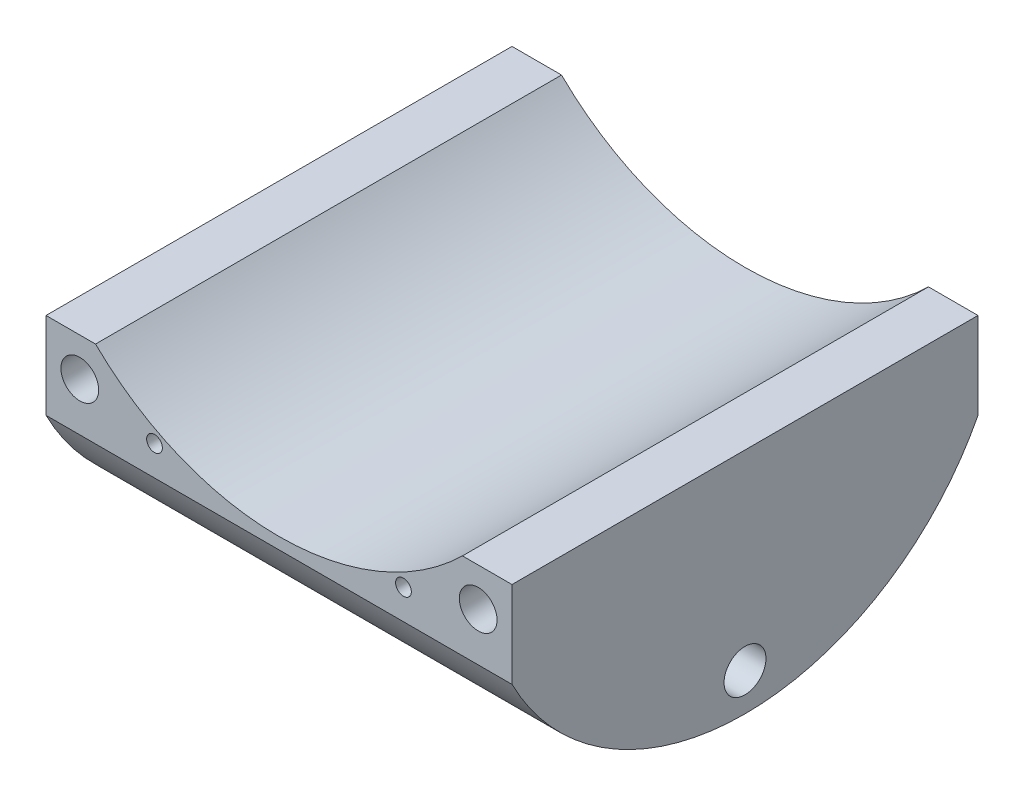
ISO-10303-21;
HEADER;
FILE_DESCRIPTION(('STEP AP214'),'2;1');
FILE_NAME('part.step','',(''),(''),'','','');
FILE_SCHEMA(('AUTOMOTIVE_DESIGN { 1 0 10303 214 1 1 1 1 }'));
ENDSEC;
DATA;
#1=APPLICATION_CONTEXT('core data for automotive mechanical design processes');
#2=APPLICATION_PROTOCOL_DEFINITION('international standard','automotive_design',2000,#1);
#3=PRODUCT_CONTEXT('',#1,'mechanical');
#4=PRODUCT('Part','Part','',(#3));
#5=PRODUCT_RELATED_PRODUCT_CATEGORY('part','',(#4));
#6=PRODUCT_DEFINITION_FORMATION('','',#4);
#7=PRODUCT_DEFINITION_CONTEXT('part definition',#1,'design');
#8=PRODUCT_DEFINITION('design','',#6,#7);
#9=PRODUCT_DEFINITION_SHAPE('','',#8);
#10=(LENGTH_UNIT() NAMED_UNIT(*) SI_UNIT(.MILLI.,.METRE.));
#11=(NAMED_UNIT(*) PLANE_ANGLE_UNIT() SI_UNIT($,.RADIAN.));
#12=(NAMED_UNIT(*) SI_UNIT($,.STERADIAN.) SOLID_ANGLE_UNIT());
#13=UNCERTAINTY_MEASURE_WITH_UNIT(LENGTH_MEASURE(1.E-05),#10,'distance_accuracy_value','');
#14=(GEOMETRIC_REPRESENTATION_CONTEXT(3) GLOBAL_UNCERTAINTY_ASSIGNED_CONTEXT((#13)) GLOBAL_UNIT_ASSIGNED_CONTEXT((#10,
#11,#12)) REPRESENTATION_CONTEXT('',''));
#15=CARTESIAN_POINT('',(0.,0.,0.));
#16=DIRECTION('',(0.,0.,1.));
#17=DIRECTION('',(1.,0.,0.));
#18=AXIS2_PLACEMENT_3D('',#15,#16,#17);
#19=CARTESIAN_POINT('',(44.45,0.,-44.45));
#20=DIRECTION('',(0.,0.,1.));
#21=DIRECTION('',(1.,0.,0.));
#22=AXIS2_PLACEMENT_3D('',#19,#20,#21);
#23=PLANE('',#22);
#24=CARTESIAN_POINT('',(-23.75,-10.8,-44.45));
#25=DIRECTION('',(0.,0.,1.));
#26=DIRECTION('',(1.,0.,0.));
#27=AXIS2_PLACEMENT_3D('',#24,#25,#26);
#28=CIRCLE('',#27,1.49999999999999);
#29=CARTESIAN_POINT('',(-25.25,-10.8,-44.45));
#30=VERTEX_POINT('',#29);
#31=EDGE_CURVE('E436',#30,#30,#28,.T.);
#32=ORIENTED_EDGE('',*,*,#31,.T.);
#33=EDGE_LOOP('',(#32));
#34=FACE_BOUND('',#33,.T.);
#35=CARTESIAN_POINT('',(-38.,-7.29999999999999,-44.45));
#36=DIRECTION('',(0.,0.,-1.));
#37=DIRECTION('',(-1.,0.,0.));
#38=AXIS2_PLACEMENT_3D('',#35,#36,#37);
#39=CIRCLE('',#38,3.59999999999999);
#40=CARTESIAN_POINT('',(-41.6,-7.29999999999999,-44.45));
#41=VERTEX_POINT('',#40);
#42=EDGE_CURVE('E127',#41,#41,#39,.T.);
#43=ORIENTED_EDGE('',*,*,#42,.F.);
#44=EDGE_LOOP('',(#43));
#45=FACE_BOUND('',#44,.T.);
#46=CARTESIAN_POINT('',(38.,-7.29999999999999,-44.45));
#47=DIRECTION('',(0.,0.,-1.));
#48=DIRECTION('',(-1.,0.,0.));
#49=AXIS2_PLACEMENT_3D('',#46,#47,#48);
#50=CIRCLE('',#49,3.59999999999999);
#51=CARTESIAN_POINT('',(34.4,-7.29999999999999,-44.45));
#52=VERTEX_POINT('',#51);
#53=EDGE_CURVE('E133',#52,#52,#50,.T.);
#54=ORIENTED_EDGE('',*,*,#53,.F.);
#55=EDGE_LOOP('',(#54));
#56=FACE_BOUND('',#55,.T.);
#57=DIRECTION('',(-1.,0.,0.));
#58=VECTOR('',#57,1.);
#59=CARTESIAN_POINT('',(44.45,0.,-44.45));
#60=LINE('',#59,#58);
#61=CARTESIAN_POINT('',(-35.,0.,-44.45));
#62=VERTEX_POINT('',#61);
#63=CARTESIAN_POINT('',(-44.45,0.,-44.45));
#64=VERTEX_POINT('',#63);
#65=EDGE_CURVE('E177',#62,#64,#60,.T.);
#66=ORIENTED_EDGE('',*,*,#65,.F.);
#67=CARTESIAN_POINT('',(0.,35.7071421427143,-44.45));
#68=DIRECTION('',(0.,0.,-1.));
#69=DIRECTION('',(-1.,0.,0.));
#70=AXIS2_PLACEMENT_3D('',#67,#68,#69);
#71=CIRCLE('',#70,50.);
#72=CARTESIAN_POINT('',(35.,0.,-44.45));
#73=VERTEX_POINT('',#72);
#74=EDGE_CURVE('E149',#73,#62,#71,.T.);
#75=ORIENTED_EDGE('',*,*,#74,.F.);
#76=CARTESIAN_POINT('',(44.45,0.,-44.45));
#77=VERTEX_POINT('',#76);
#78=EDGE_CURVE('E178',#77,#73,#60,.T.);
#79=ORIENTED_EDGE('',*,*,#78,.F.);
#80=DIRECTION('',(0.,1.,0.));
#81=VECTOR('',#80,1.);
#82=CARTESIAN_POINT('',(44.45,0.,-44.45));
#83=LINE('',#82,#81);
#84=CARTESIAN_POINT('',(44.45,-16.5,-44.45));
#85=VERTEX_POINT('',#84);
#86=EDGE_CURVE('E164',#85,#77,#83,.T.);
#87=ORIENTED_EDGE('',*,*,#86,.F.);
#88=DIRECTION('',(-1.,0.,0.));
#89=VECTOR('',#88,1.);
#90=CARTESIAN_POINT('',(44.45,-16.5,-44.45));
#91=LINE('',#90,#89);
#92=CARTESIAN_POINT('',(-44.45,-16.5,-44.45));
#93=VERTEX_POINT('',#92);
#94=EDGE_CURVE('E40',#85,#93,#91,.T.);
#95=ORIENTED_EDGE('',*,*,#94,.T.);
#96=DIRECTION('',(0.,1.,0.));
#97=VECTOR('',#96,1.);
#98=CARTESIAN_POINT('',(-44.45,0.,-44.45));
#99=LINE('',#98,#97);
#100=EDGE_CURVE('E170',#93,#64,#99,.T.);
#101=ORIENTED_EDGE('',*,*,#100,.T.);
#102=EDGE_LOOP('',(#66,#75,#79,#87,#95,#101));
#103=FACE_BOUND('',#102,.T.);
#104=CARTESIAN_POINT('',(23.75,-10.8,-44.45));
#105=DIRECTION('',(0.,0.,1.));
#106=DIRECTION('',(1.,0.,0.));
#107=AXIS2_PLACEMENT_3D('',#104,#105,#106);
#108=CIRCLE('',#107,1.49999999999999);
#109=CARTESIAN_POINT('',(22.25,-10.8,-44.45));
#110=VERTEX_POINT('',#109);
#111=EDGE_CURVE('E437',#110,#110,#108,.T.);
#112=ORIENTED_EDGE('',*,*,#111,.T.);
#113=EDGE_LOOP('',(#112));
#114=FACE_BOUND('',#113,.T.);
#115=ADVANCED_FACE('F32',(#34,#45,#56,#103,#114),#23,.F.);
#116=CARTESIAN_POINT('',(-44.45,6.39535979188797,0.));
#117=DIRECTION('',(1.,0.,0.));
#118=DIRECTION('',(0.,0.,-1.));
#119=AXIS2_PLACEMENT_3D('',#116,#117,#118);
#120=PLANE('',#119);
#121=DIRECTION('',(0.,-1.,0.));
#122=VECTOR('',#121,1.);
#123=CARTESIAN_POINT('',(-44.45,0.,44.45));
#124=LINE('',#123,#122);
#125=CARTESIAN_POINT('',(-44.45,0.,44.45));
#126=VERTEX_POINT('',#125);
#127=CARTESIAN_POINT('',(-44.45,-16.5,44.45));
#128=VERTEX_POINT('',#127);
#129=EDGE_CURVE('E157',#126,#128,#124,.T.);
#130=ORIENTED_EDGE('',*,*,#129,.F.);
#131=DIRECTION('',(0.,0.,1.));
#132=VECTOR('',#131,1.);
#133=CARTESIAN_POINT('',(-44.45,0.,44.45));
#134=LINE('',#133,#132);
#135=EDGE_CURVE('E162',#64,#126,#134,.T.);
#136=ORIENTED_EDGE('',*,*,#135,.F.);
#137=ORIENTED_EDGE('',*,*,#100,.F.);
#138=CARTESIAN_POINT('',(-44.45,6.39535979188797,0.));
#139=DIRECTION('',(1.,0.,0.));
#140=DIRECTION('',(0.,0.,-1.));
#141=AXIS2_PLACEMENT_3D('',#138,#139,#140);
#142=CIRCLE('',#141,50.);
#143=EDGE_CURVE('E168',#128,#93,#142,.T.);
#144=ORIENTED_EDGE('',*,*,#143,.F.);
#145=EDGE_LOOP('',(#130,#136,#137,#144));
#146=FACE_BOUND('',#145,.T.);
#147=CARTESIAN_POINT('',(-44.45,-36.45,0.));
#148=DIRECTION('',(1.,0.,0.));
#149=DIRECTION('',(0.,0.,-1.));
#150=AXIS2_PLACEMENT_3D('',#147,#148,#149);
#151=CIRCLE('',#150,4.);
#152=CARTESIAN_POINT('',(-44.45,-36.45,-4.));
#153=VERTEX_POINT('',#152);
#154=EDGE_CURVE('E139',#153,#153,#151,.T.);
#155=ORIENTED_EDGE('',*,*,#154,.T.);
#156=EDGE_LOOP('',(#155));
#157=FACE_BOUND('',#156,.T.);
#158=ADVANCED_FACE('F190',(#146,#157),#120,.F.);
#159=CARTESIAN_POINT('',(44.45,0.,44.45));
#160=DIRECTION('',(0.,-1.,0.));
#161=DIRECTION('',(0.,0.,-1.));
#162=AXIS2_PLACEMENT_3D('',#159,#160,#161);
#163=PLANE('',#162);
#164=DIRECTION('',(-1.,0.,0.));
#165=VECTOR('',#164,1.);
#166=CARTESIAN_POINT('',(44.45,0.,44.45));
#167=LINE('',#166,#165);
#168=CARTESIAN_POINT('',(-35.,0.,44.45));
#169=VERTEX_POINT('',#168);
#170=EDGE_CURVE('E77',#169,#126,#167,.T.);
#171=ORIENTED_EDGE('',*,*,#170,.F.);
#172=DIRECTION('',(0.,0.,-1.));
#173=VECTOR('',#172,1.);
#174=CARTESIAN_POINT('',(-35.,0.,44.45));
#175=LINE('',#174,#173);
#176=EDGE_CURVE('E153',#169,#62,#175,.T.);
#177=ORIENTED_EDGE('',*,*,#176,.T.);
#178=ORIENTED_EDGE('',*,*,#65,.T.);
#179=ORIENTED_EDGE('',*,*,#135,.T.);
#180=EDGE_LOOP('',(#171,#177,#178,#179));
#181=FACE_BOUND('',#180,.T.);
#182=ADVANCED_FACE('F193',(#181),#163,.F.);
#183=CARTESIAN_POINT('',(44.45,0.,44.45));
#184=DIRECTION('',(0.,0.,-1.));
#185=DIRECTION('',(-1.,0.,0.));
#186=AXIS2_PLACEMENT_3D('',#183,#184,#185);
#187=PLANE('',#186);
#188=CARTESIAN_POINT('',(23.75,-10.8,44.45));
#189=DIRECTION('',(0.,0.,1.));
#190=DIRECTION('',(1.,0.,0.));
#191=AXIS2_PLACEMENT_3D('',#188,#189,#190);
#192=CIRCLE('',#191,1.49999999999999);
#193=CARTESIAN_POINT('',(25.25,-10.8,44.45));
#194=VERTEX_POINT('',#193);
#195=EDGE_CURVE('E233',#194,#194,#192,.T.);
#196=ORIENTED_EDGE('',*,*,#195,.F.);
#197=EDGE_LOOP('',(#196));
#198=FACE_BOUND('',#197,.T.);
#199=CARTESIAN_POINT('',(-23.75,-10.8,44.45));
#200=DIRECTION('',(0.,0.,1.));
#201=DIRECTION('',(1.,0.,0.));
#202=AXIS2_PLACEMENT_3D('',#199,#200,#201);
#203=CIRCLE('',#202,1.49999999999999);
#204=CARTESIAN_POINT('',(-22.25,-10.8,44.45));
#205=VERTEX_POINT('',#204);
#206=EDGE_CURVE('E237',#205,#205,#203,.T.);
#207=ORIENTED_EDGE('',*,*,#206,.F.);
#208=EDGE_LOOP('',(#207));
#209=FACE_BOUND('',#208,.T.);
#210=CARTESIAN_POINT('',(-38.,-7.29999999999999,44.45));
#211=DIRECTION('',(0.,0.,1.));
#212=DIRECTION('',(1.,0.,0.));
#213=AXIS2_PLACEMENT_3D('',#210,#211,#212);
#214=CIRCLE('',#213,3.59999999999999);
#215=CARTESIAN_POINT('',(-34.4,-7.29999999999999,44.45));
#216=VERTEX_POINT('',#215);
#217=EDGE_CURVE('E115',#216,#216,#214,.T.);
#218=ORIENTED_EDGE('',*,*,#217,.F.);
#219=EDGE_LOOP('',(#218));
#220=FACE_BOUND('',#219,.T.);
#221=CARTESIAN_POINT('',(38.,-7.29999999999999,44.45));
#222=DIRECTION('',(0.,0.,1.));
#223=DIRECTION('',(1.,0.,0.));
#224=AXIS2_PLACEMENT_3D('',#221,#222,#223);
#225=CIRCLE('',#224,3.59999999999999);
#226=CARTESIAN_POINT('',(41.6,-7.29999999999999,44.45));
#227=VERTEX_POINT('',#226);
#228=EDGE_CURVE('E114',#227,#227,#225,.T.);
#229=ORIENTED_EDGE('',*,*,#228,.F.);
#230=EDGE_LOOP('',(#229));
#231=FACE_BOUND('',#230,.T.);
#232=CARTESIAN_POINT('',(44.45,0.,44.45));
#233=VERTEX_POINT('',#232);
#234=CARTESIAN_POINT('',(35.,0.,44.45));
#235=VERTEX_POINT('',#234);
#236=EDGE_CURVE('E174',#233,#235,#167,.T.);
#237=ORIENTED_EDGE('',*,*,#236,.T.);
#238=CARTESIAN_POINT('',(0.,35.7071421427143,44.45));
#239=DIRECTION('',(0.,0.,-1.));
#240=DIRECTION('',(-1.,0.,0.));
#241=AXIS2_PLACEMENT_3D('',#238,#239,#240);
#242=CIRCLE('',#241,50.);
#243=EDGE_CURVE('E47',#235,#169,#242,.T.);
#244=ORIENTED_EDGE('',*,*,#243,.T.);
#245=ORIENTED_EDGE('',*,*,#170,.T.);
#246=ORIENTED_EDGE('',*,*,#129,.T.);
#247=DIRECTION('',(-1.,0.,0.));
#248=VECTOR('',#247,1.);
#249=CARTESIAN_POINT('',(44.45,-16.5,44.45));
#250=LINE('',#249,#248);
#251=CARTESIAN_POINT('',(44.45,-16.5,44.45));
#252=VERTEX_POINT('',#251);
#253=EDGE_CURVE('E11',#252,#128,#250,.T.);
#254=ORIENTED_EDGE('',*,*,#253,.F.);
#255=DIRECTION('',(0.,-1.,0.));
#256=VECTOR('',#255,1.);
#257=CARTESIAN_POINT('',(44.45,0.,44.45));
#258=LINE('',#257,#256);
#259=EDGE_CURVE('E160',#233,#252,#258,.T.);
#260=ORIENTED_EDGE('',*,*,#259,.F.);
#261=EDGE_LOOP('',(#237,#244,#245,#246,#254,#260));
#262=FACE_BOUND('',#261,.T.);
#263=ADVANCED_FACE('F34',(#198,#209,#220,#231,#262),#187,.F.);
#264=CARTESIAN_POINT('',(44.45,6.39535979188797,0.));
#265=DIRECTION('',(-1.,0.,0.));
#266=DIRECTION('',(0.,0.,1.));
#267=AXIS2_PLACEMENT_3D('',#264,#265,#266);
#268=CYLINDRICAL_SURFACE('',#267,50.);
#269=ORIENTED_EDGE('',*,*,#143,.T.);
#270=ORIENTED_EDGE('',*,*,#94,.F.);
#271=CARTESIAN_POINT('',(44.45,6.39535979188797,0.));
#272=DIRECTION('',(1.,0.,0.));
#273=DIRECTION('',(0.,0.,-1.));
#274=AXIS2_PLACEMENT_3D('',#271,#272,#273);
#275=CIRCLE('',#274,50.);
#276=EDGE_CURVE('E84',#252,#85,#275,.T.);
#277=ORIENTED_EDGE('',*,*,#276,.F.);
#278=ORIENTED_EDGE('',*,*,#253,.T.);
#279=EDGE_LOOP('',(#269,#270,#277,#278));
#280=FACE_BOUND('',#279,.T.);
#281=ADVANCED_FACE('F210',(#280),#268,.T.);
#282=ORIENTED_EDGE('',*,*,#78,.T.);
#283=DIRECTION('',(0.,0.,-1.));
#284=VECTOR('',#283,1.);
#285=CARTESIAN_POINT('',(35.,0.,44.45));
#286=LINE('',#285,#284);
#287=EDGE_CURVE('E155',#235,#73,#286,.T.);
#288=ORIENTED_EDGE('',*,*,#287,.F.);
#289=ORIENTED_EDGE('',*,*,#236,.F.);
#290=DIRECTION('',(0.,0.,1.));
#291=VECTOR('',#290,1.);
#292=CARTESIAN_POINT('',(44.45,0.,44.45));
#293=LINE('',#292,#291);
#294=EDGE_CURVE('E56',#77,#233,#293,.T.);
#295=ORIENTED_EDGE('',*,*,#294,.F.);
#296=EDGE_LOOP('',(#282,#288,#289,#295));
#297=FACE_BOUND('',#296,.T.);
#298=ADVANCED_FACE('F196',(#297),#163,.F.);
#299=CARTESIAN_POINT('',(44.45,6.39535979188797,0.));
#300=DIRECTION('',(1.,0.,0.));
#301=DIRECTION('',(0.,0.,-1.));
#302=AXIS2_PLACEMENT_3D('',#299,#300,#301);
#303=PLANE('',#302);
#304=CARTESIAN_POINT('',(44.45,-36.45,0.));
#305=DIRECTION('',(1.,0.,0.));
#306=DIRECTION('',(0.,0.,-1.));
#307=AXIS2_PLACEMENT_3D('',#304,#305,#306);
#308=CIRCLE('',#307,4.);
#309=CARTESIAN_POINT('',(44.45,-36.45,-4.));
#310=VERTEX_POINT('',#309);
#311=EDGE_CURVE('E143',#310,#310,#308,.T.);
#312=ORIENTED_EDGE('',*,*,#311,.F.);
#313=EDGE_LOOP('',(#312));
#314=FACE_BOUND('',#313,.T.);
#315=ORIENTED_EDGE('',*,*,#259,.T.);
#316=ORIENTED_EDGE('',*,*,#276,.T.);
#317=ORIENTED_EDGE('',*,*,#86,.T.);
#318=ORIENTED_EDGE('',*,*,#294,.T.);
#319=EDGE_LOOP('',(#315,#316,#317,#318));
#320=FACE_BOUND('',#319,.T.);
#321=ADVANCED_FACE('F199',(#314,#320),#303,.T.);
#322=CARTESIAN_POINT('',(0.,35.7071421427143,44.45));
#323=DIRECTION('',(0.,0.,-1.));
#324=DIRECTION('',(-1.,0.,0.));
#325=AXIS2_PLACEMENT_3D('',#322,#323,#324);
#326=CYLINDRICAL_SURFACE('',#325,50.);
#327=ORIENTED_EDGE('',*,*,#74,.T.);
#328=ORIENTED_EDGE('',*,*,#176,.F.);
#329=ORIENTED_EDGE('',*,*,#243,.F.);
#330=ORIENTED_EDGE('',*,*,#287,.T.);
#331=EDGE_LOOP('',(#327,#328,#329,#330));
#332=FACE_BOUND('',#331,.T.);
#333=ADVANCED_FACE('F201',(#332),#326,.F.);
#334=CARTESIAN_POINT('',(26.95,-36.45,0.));
#335=DIRECTION('',(1.,0.,0.));
#336=DIRECTION('',(0.,0.,-1.));
#337=AXIS2_PLACEMENT_3D('',#334,#335,#336);
#338=CYLINDRICAL_SURFACE('',#337,4.);
#339=CARTESIAN_POINT('',(26.95,-36.45,0.));
#340=DIRECTION('',(1.,0.,0.));
#341=DIRECTION('',(0.,0.,-1.));
#342=AXIS2_PLACEMENT_3D('',#339,#340,#341);
#343=CIRCLE('',#342,4.);
#344=CARTESIAN_POINT('',(26.95,-36.45,-4.));
#345=VERTEX_POINT('',#344);
#346=EDGE_CURVE('E146',#345,#345,#343,.T.);
#347=ORIENTED_EDGE('',*,*,#346,.F.);
#348=EDGE_LOOP('',(#347));
#349=FACE_BOUND('',#348,.T.);
#350=ORIENTED_EDGE('',*,*,#311,.T.);
#351=EDGE_LOOP('',(#350));
#352=FACE_BOUND('',#351,.T.);
#353=ADVANCED_FACE('F208',(#349,#352),#338,.F.);
#354=CARTESIAN_POINT('',(26.95,-36.45,0.));
#355=DIRECTION('',(1.,0.,0.));
#356=DIRECTION('',(0.,0.,-1.));
#357=AXIS2_PLACEMENT_3D('',#354,#355,#356);
#358=PLANE('',#357);
#359=ORIENTED_EDGE('',*,*,#346,.T.);
#360=EDGE_LOOP('',(#359));
#361=FACE_BOUND('',#360,.T.);
#362=ADVANCED_FACE('F277',(#361),#358,.T.);
#363=CARTESIAN_POINT('',(-26.95,-36.45,0.));
#364=DIRECTION('',(-1.,0.,0.));
#365=DIRECTION('',(0.,0.,1.));
#366=AXIS2_PLACEMENT_3D('',#363,#364,#365);
#367=CYLINDRICAL_SURFACE('',#366,4.);
#368=CARTESIAN_POINT('',(-26.95,-36.45,0.));
#369=DIRECTION('',(1.,0.,0.));
#370=DIRECTION('',(0.,0.,-1.));
#371=AXIS2_PLACEMENT_3D('',#368,#369,#370);
#372=CIRCLE('',#371,4.);
#373=CARTESIAN_POINT('',(-26.95,-36.45,-4.));
#374=VERTEX_POINT('',#373);
#375=EDGE_CURVE('E140',#374,#374,#372,.T.);
#376=ORIENTED_EDGE('',*,*,#375,.T.);
#377=EDGE_LOOP('',(#376));
#378=FACE_BOUND('',#377,.T.);
#379=ORIENTED_EDGE('',*,*,#154,.F.);
#380=EDGE_LOOP('',(#379));
#381=FACE_BOUND('',#380,.T.);
#382=ADVANCED_FACE('F273',(#378,#381),#367,.F.);
#383=CARTESIAN_POINT('',(-26.95,-36.45,0.));
#384=DIRECTION('',(-1.,0.,0.));
#385=DIRECTION('',(0.,0.,-1.));
#386=AXIS2_PLACEMENT_3D('',#383,#384,#385);
#387=PLANE('',#386);
#388=ORIENTED_EDGE('',*,*,#375,.F.);
#389=EDGE_LOOP('',(#388));
#390=FACE_BOUND('',#389,.T.);
#391=ADVANCED_FACE('F269',(#390),#387,.T.);
#392=CARTESIAN_POINT('',(38.,-7.29999999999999,-23.8));
#393=DIRECTION('',(0.,0.,-1.));
#394=DIRECTION('',(-1.,0.,0.));
#395=AXIS2_PLACEMENT_3D('',#392,#393,#394);
#396=CONICAL_SURFACE('',#395,3.6,1.02974425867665);
#397=CARTESIAN_POINT('',(38.,-7.29999999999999,-21.6369017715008));
#398=VERTEX_POINT('',#397);
#399=VERTEX_LOOP('',#398);
#400=FACE_BOUND('',#399,.T.);
#401=CARTESIAN_POINT('',(38.,-7.29999999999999,-23.8));
#402=DIRECTION('',(0.,0.,-1.));
#403=DIRECTION('',(-1.,0.,0.));
#404=AXIS2_PLACEMENT_3D('',#401,#402,#403);
#405=CIRCLE('',#404,3.6);
#406=CARTESIAN_POINT('',(34.4,-7.29999999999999,-23.8));
#407=VERTEX_POINT('',#406);
#408=EDGE_CURVE('E136',#407,#407,#405,.T.);
#409=ORIENTED_EDGE('',*,*,#408,.T.);
#410=EDGE_LOOP('',(#409));
#411=FACE_BOUND('',#410,.T.);
#412=ADVANCED_FACE('F265',(#400,#411),#396,.F.);
#413=CARTESIAN_POINT('',(38.,-7.29999999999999,-44.45));
#414=DIRECTION('',(0.,0.,-1.));
#415=DIRECTION('',(-1.,0.,0.));
#416=AXIS2_PLACEMENT_3D('',#413,#414,#415);
#417=CYLINDRICAL_SURFACE('',#416,3.6);
#418=ORIENTED_EDGE('',*,*,#408,.F.);
#419=EDGE_LOOP('',(#418));
#420=FACE_BOUND('',#419,.T.);
#421=ORIENTED_EDGE('',*,*,#53,.T.);
#422=EDGE_LOOP('',(#421));
#423=FACE_BOUND('',#422,.T.);
#424=ADVANCED_FACE('F261',(#420,#423),#417,.F.);
#425=CARTESIAN_POINT('',(-38.,-7.29999999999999,-23.8));
#426=DIRECTION('',(0.,0.,-1.));
#427=DIRECTION('',(-1.,0.,0.));
#428=AXIS2_PLACEMENT_3D('',#425,#426,#427);
#429=CONICAL_SURFACE('',#428,3.6,1.02974425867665);
#430=CARTESIAN_POINT('',(-38.,-7.29999999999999,-21.6369017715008));
#431=VERTEX_POINT('',#430);
#432=VERTEX_LOOP('',#431);
#433=FACE_BOUND('',#432,.T.);
#434=CARTESIAN_POINT('',(-38.,-7.29999999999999,-23.8));
#435=DIRECTION('',(0.,0.,-1.));
#436=DIRECTION('',(-1.,0.,0.));
#437=AXIS2_PLACEMENT_3D('',#434,#435,#436);
#438=CIRCLE('',#437,3.6);
#439=CARTESIAN_POINT('',(-41.6,-7.29999999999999,-23.8));
#440=VERTEX_POINT('',#439);
#441=EDGE_CURVE('E130',#440,#440,#438,.T.);
#442=ORIENTED_EDGE('',*,*,#441,.T.);
#443=EDGE_LOOP('',(#442));
#444=FACE_BOUND('',#443,.T.);
#445=ADVANCED_FACE('F257',(#433,#444),#429,.F.);
#446=CARTESIAN_POINT('',(-38.,-7.29999999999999,-44.45));
#447=DIRECTION('',(0.,0.,-1.));
#448=DIRECTION('',(-1.,0.,0.));
#449=AXIS2_PLACEMENT_3D('',#446,#447,#448);
#450=CYLINDRICAL_SURFACE('',#449,3.6);
#451=ORIENTED_EDGE('',*,*,#441,.F.);
#452=EDGE_LOOP('',(#451));
#453=FACE_BOUND('',#452,.T.);
#454=ORIENTED_EDGE('',*,*,#42,.T.);
#455=EDGE_LOOP('',(#454));
#456=FACE_BOUND('',#455,.T.);
#457=ADVANCED_FACE('F249',(#453,#456),#450,.F.);
#458=CARTESIAN_POINT('',(38.,-7.29999999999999,23.8));
#459=DIRECTION('',(0.,0.,1.));
#460=DIRECTION('',(1.,0.,0.));
#461=AXIS2_PLACEMENT_3D('',#458,#459,#460);
#462=CONICAL_SURFACE('',#461,3.6,1.02974425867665);
#463=CARTESIAN_POINT('',(38.,-7.29999999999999,21.6369017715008));
#464=VERTEX_POINT('',#463);
#465=VERTEX_LOOP('',#464);
#466=FACE_BOUND('',#465,.T.);
#467=CARTESIAN_POINT('',(38.,-7.29999999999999,23.8));
#468=DIRECTION('',(0.,0.,1.));
#469=DIRECTION('',(1.,0.,0.));
#470=AXIS2_PLACEMENT_3D('',#467,#468,#469);
#471=CIRCLE('',#470,3.6);
#472=CARTESIAN_POINT('',(41.6,-7.29999999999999,23.8));
#473=VERTEX_POINT('',#472);
#474=EDGE_CURVE('E118',#473,#473,#471,.T.);
#475=ORIENTED_EDGE('',*,*,#474,.T.);
#476=EDGE_LOOP('',(#475));
#477=FACE_BOUND('',#476,.T.);
#478=ADVANCED_FACE('F243',(#466,#477),#462,.F.);
#479=CARTESIAN_POINT('',(38.,-7.29999999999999,44.45));
#480=DIRECTION('',(0.,0.,1.));
#481=DIRECTION('',(1.,0.,0.));
#482=AXIS2_PLACEMENT_3D('',#479,#480,#481);
#483=CYLINDRICAL_SURFACE('',#482,3.6);
#484=ORIENTED_EDGE('',*,*,#474,.F.);
#485=EDGE_LOOP('',(#484));
#486=FACE_BOUND('',#485,.T.);
#487=ORIENTED_EDGE('',*,*,#228,.T.);
#488=EDGE_LOOP('',(#487));
#489=FACE_BOUND('',#488,.T.);
#490=ADVANCED_FACE('F108',(#486,#489),#483,.F.);
#491=CARTESIAN_POINT('',(-38.,-7.29999999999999,23.8));
#492=DIRECTION('',(0.,0.,1.));
#493=DIRECTION('',(1.,0.,0.));
#494=AXIS2_PLACEMENT_3D('',#491,#492,#493);
#495=CONICAL_SURFACE('',#494,3.6,1.02974425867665);
#496=CARTESIAN_POINT('',(-38.,-7.29999999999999,21.6369017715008));
#497=VERTEX_POINT('',#496);
#498=VERTEX_LOOP('',#497);
#499=FACE_BOUND('',#498,.T.);
#500=CARTESIAN_POINT('',(-38.,-7.29999999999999,23.8));
#501=DIRECTION('',(0.,0.,1.));
#502=DIRECTION('',(1.,0.,0.));
#503=AXIS2_PLACEMENT_3D('',#500,#501,#502);
#504=CIRCLE('',#503,3.6);
#505=CARTESIAN_POINT('',(-34.4,-7.29999999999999,23.8));
#506=VERTEX_POINT('',#505);
#507=EDGE_CURVE('E112',#506,#506,#504,.T.);
#508=ORIENTED_EDGE('',*,*,#507,.T.);
#509=EDGE_LOOP('',(#508));
#510=FACE_BOUND('',#509,.T.);
#511=ADVANCED_FACE('F104',(#499,#510),#495,.F.);
#512=CARTESIAN_POINT('',(-38.,-7.29999999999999,44.45));
#513=DIRECTION('',(0.,0.,1.));
#514=DIRECTION('',(1.,0.,0.));
#515=AXIS2_PLACEMENT_3D('',#512,#513,#514);
#516=CYLINDRICAL_SURFACE('',#515,3.6);
#517=ORIENTED_EDGE('',*,*,#507,.F.);
#518=EDGE_LOOP('',(#517));
#519=FACE_BOUND('',#518,.T.);
#520=ORIENTED_EDGE('',*,*,#217,.T.);
#521=EDGE_LOOP('',(#520));
#522=FACE_BOUND('',#521,.T.);
#523=ADVANCED_FACE('F107',(#519,#522),#516,.F.);
#524=CARTESIAN_POINT('',(-23.75,-10.8,29.95));
#525=DIRECTION('',(0.,0.,1.));
#526=DIRECTION('',(1.,0.,0.));
#527=AXIS2_PLACEMENT_3D('',#524,#525,#526);
#528=CYLINDRICAL_SURFACE('',#527,1.49999999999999);
#529=CARTESIAN_POINT('',(-23.75,-10.8,29.95));
#530=DIRECTION('',(0.,0.,1.));
#531=DIRECTION('',(1.,0.,0.));
#532=AXIS2_PLACEMENT_3D('',#529,#530,#531);
#533=CIRCLE('',#532,1.49999999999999);
#534=CARTESIAN_POINT('',(-22.25,-10.8,29.95));
#535=VERTEX_POINT('',#534);
#536=EDGE_CURVE('E121',#535,#535,#533,.T.);
#537=CARTESIAN_POINT('',(-22.25,-10.8,29.95));
#538=CARTESIAN_POINT('',(-22.25,-10.8,30.1010416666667));
#539=CARTESIAN_POINT('',(-22.25,-10.8,30.2520833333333));
#540=CARTESIAN_POINT('',(-22.25,-10.8,30.5541666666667));
#541=CARTESIAN_POINT('',(-22.25,-10.8,30.7052083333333));
#542=CARTESIAN_POINT('',(-22.25,-10.8,31.0072916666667));
#543=CARTESIAN_POINT('',(-22.25,-10.8,31.1583333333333));
#544=CARTESIAN_POINT('',(-22.25,-10.8,31.4604166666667));
#545=CARTESIAN_POINT('',(-22.25,-10.8,31.6114583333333));
#546=CARTESIAN_POINT('',(-22.25,-10.8,31.9135416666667));
#547=CARTESIAN_POINT('',(-22.25,-10.8,32.0645833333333));
#548=CARTESIAN_POINT('',(-22.25,-10.8,32.3666666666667));
#549=CARTESIAN_POINT('',(-22.25,-10.8,32.5177083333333));
#550=CARTESIAN_POINT('',(-22.25,-10.8,32.8197916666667));
#551=CARTESIAN_POINT('',(-22.25,-10.8,32.9708333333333));
#552=CARTESIAN_POINT('',(-22.25,-10.8,33.2729166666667));
#553=CARTESIAN_POINT('',(-22.25,-10.8,33.4239583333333));
#554=CARTESIAN_POINT('',(-22.25,-10.8,33.7260416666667));
#555=CARTESIAN_POINT('',(-22.25,-10.8,33.8770833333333));
#556=CARTESIAN_POINT('',(-22.25,-10.8,34.1791666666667));
#557=CARTESIAN_POINT('',(-22.25,-10.8,34.3302083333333));
#558=CARTESIAN_POINT('',(-22.25,-10.8,34.6322916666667));
#559=CARTESIAN_POINT('',(-22.25,-10.8,34.7833333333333));
#560=CARTESIAN_POINT('',(-22.25,-10.8,35.0854166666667));
#561=CARTESIAN_POINT('',(-22.25,-10.8,35.2364583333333));
#562=CARTESIAN_POINT('',(-22.25,-10.8,35.5385416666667));
#563=CARTESIAN_POINT('',(-22.25,-10.8,35.6895833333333));
#564=CARTESIAN_POINT('',(-22.25,-10.8,35.9916666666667));
#565=CARTESIAN_POINT('',(-22.25,-10.8,36.1427083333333));
#566=CARTESIAN_POINT('',(-22.25,-10.8,36.4447916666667));
#567=CARTESIAN_POINT('',(-22.25,-10.8,36.5958333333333));
#568=CARTESIAN_POINT('',(-22.25,-10.8,36.8979166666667));
#569=CARTESIAN_POINT('',(-22.25,-10.8,37.0489583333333));
#570=CARTESIAN_POINT('',(-22.25,-10.8,37.3510416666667));
#571=CARTESIAN_POINT('',(-22.25,-10.8,37.5020833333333));
#572=CARTESIAN_POINT('',(-22.25,-10.8,37.8041666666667));
#573=CARTESIAN_POINT('',(-22.25,-10.8,37.9552083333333));
#574=CARTESIAN_POINT('',(-22.25,-10.8,38.2572916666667));
#575=CARTESIAN_POINT('',(-22.25,-10.8,38.4083333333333));
#576=CARTESIAN_POINT('',(-22.25,-10.8,38.7104166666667));
#577=CARTESIAN_POINT('',(-22.25,-10.8,38.8614583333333));
#578=CARTESIAN_POINT('',(-22.25,-10.8,39.1635416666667));
#579=CARTESIAN_POINT('',(-22.25,-10.8,39.3145833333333));
#580=CARTESIAN_POINT('',(-22.25,-10.8,39.6166666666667));
#581=CARTESIAN_POINT('',(-22.25,-10.8,39.7677083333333));
#582=CARTESIAN_POINT('',(-22.25,-10.8,40.0697916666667));
#583=CARTESIAN_POINT('',(-22.25,-10.8,40.2208333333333));
#584=CARTESIAN_POINT('',(-22.25,-10.8,40.5229166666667));
#585=CARTESIAN_POINT('',(-22.25,-10.8,40.6739583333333));
#586=CARTESIAN_POINT('',(-22.25,-10.8,40.9760416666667));
#587=CARTESIAN_POINT('',(-22.25,-10.8,41.1270833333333));
#588=CARTESIAN_POINT('',(-22.25,-10.8,41.4291666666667));
#589=CARTESIAN_POINT('',(-22.25,-10.8,41.5802083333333));
#590=CARTESIAN_POINT('',(-22.25,-10.8,41.8822916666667));
#591=CARTESIAN_POINT('',(-22.25,-10.8,42.0333333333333));
#592=CARTESIAN_POINT('',(-22.25,-10.8,42.3354166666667));
#593=CARTESIAN_POINT('',(-22.25,-10.8,42.4864583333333));
#594=CARTESIAN_POINT('',(-22.25,-10.8,42.7885416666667));
#595=CARTESIAN_POINT('',(-22.25,-10.8,42.9395833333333));
#596=CARTESIAN_POINT('',(-22.25,-10.8,43.2416666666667));
#597=CARTESIAN_POINT('',(-22.25,-10.8,43.3927083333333));
#598=CARTESIAN_POINT('',(-22.25,-10.8,43.6947916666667));
#599=CARTESIAN_POINT('',(-22.25,-10.8,43.8458333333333));
#600=CARTESIAN_POINT('',(-22.25,-10.8,44.1479166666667));
#601=CARTESIAN_POINT('',(-22.25,-10.8,44.2989583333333));
#602=CARTESIAN_POINT('',(-22.25,-10.8,44.45));
#603=B_SPLINE_CURVE_WITH_KNOTS('',3,(#537,#538,#539,#540,#541,#542,#543,#544,#545,#546,#547,
#548,#549,#550,#551,#552,#553,#554,#555,#556,#557,#558,#559,#560,#561,#562,#563,#564,#565,#566,
#567,#568,#569,#570,#571,#572,#573,#574,#575,#576,#577,#578,#579,#580,#581,#582,#583,#584,#585,
#586,#587,#588,#589,#590,#591,#592,#593,#594,#595,#596,#597,#598,#599,#600,#601,#602),
.UNSPECIFIED.,.F.,.F.,(4,2,2,2,2,2,2,2,2,2,2,2,2,2,2,2,2,2,2,2,2,2,2,2,2,2,2,2,2,2,2,2,4),(0.,
0.453125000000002,0.906250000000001,1.359375,1.8125,2.265625,2.71875,3.171875,3.625,4.078125,
4.53125,4.984375,5.4375,5.890625,6.34375,6.796875,7.25,7.703125,8.15625,8.609375,9.0625,
9.515625,9.96875,10.421875,10.875,11.328125,11.78125,12.234375,12.6875,13.140625,13.59375,
14.046875,14.5),.UNSPECIFIED.);
#604=EDGE_CURVE('BSEAM341',#535,#205,#603,.T.);
#605=ORIENTED_EDGE('',*,*,#536,.F.);
#606=ORIENTED_EDGE('',*,*,#206,.T.);
#607=ORIENTED_EDGE('',*,*,#604,.T.);
#608=ORIENTED_EDGE('',*,*,#604,.F.);
#609=EDGE_LOOP('',(#605,#607,#606,#608));
#610=FACE_BOUND('',#609,.T.);
#611=ADVANCED_FACE('F341',(#610),#528,.F.);
#612=CARTESIAN_POINT('',(-23.75,-10.8,29.95));
#613=DIRECTION('',(0.,0.,1.));
#614=DIRECTION('',(1.,0.,0.));
#615=AXIS2_PLACEMENT_3D('',#612,#613,#614);
#616=PLANE('',#615);
#617=ORIENTED_EDGE('',*,*,#536,.T.);
#618=EDGE_LOOP('',(#617));
#619=FACE_BOUND('',#618,.T.);
#620=ADVANCED_FACE('F355',(#619),#616,.T.);
#621=CARTESIAN_POINT('',(23.75,-10.8,29.95));
#622=DIRECTION('',(0.,0.,1.));
#623=DIRECTION('',(1.,0.,0.));
#624=AXIS2_PLACEMENT_3D('',#621,#622,#623);
#625=CYLINDRICAL_SURFACE('',#624,1.49999999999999);
#626=CARTESIAN_POINT('',(23.75,-10.8,29.95));
#627=DIRECTION('',(0.,0.,1.));
#628=DIRECTION('',(1.,0.,0.));
#629=AXIS2_PLACEMENT_3D('',#626,#627,#628);
#630=CIRCLE('',#629,1.49999999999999);
#631=CARTESIAN_POINT('',(25.25,-10.8,29.95));
#632=VERTEX_POINT('',#631);
#633=EDGE_CURVE('E446',#632,#632,#630,.T.);
#634=CARTESIAN_POINT('',(25.25,-10.8,29.95));
#635=CARTESIAN_POINT('',(25.25,-10.8,30.1010416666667));
#636=CARTESIAN_POINT('',(25.25,-10.8,30.2520833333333));
#637=CARTESIAN_POINT('',(25.25,-10.8,30.5541666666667));
#638=CARTESIAN_POINT('',(25.25,-10.8,30.7052083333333));
#639=CARTESIAN_POINT('',(25.25,-10.8,31.0072916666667));
#640=CARTESIAN_POINT('',(25.25,-10.8,31.1583333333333));
#641=CARTESIAN_POINT('',(25.25,-10.8,31.4604166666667));
#642=CARTESIAN_POINT('',(25.25,-10.8,31.6114583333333));
#643=CARTESIAN_POINT('',(25.25,-10.8,31.9135416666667));
#644=CARTESIAN_POINT('',(25.25,-10.8,32.0645833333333));
#645=CARTESIAN_POINT('',(25.25,-10.8,32.3666666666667));
#646=CARTESIAN_POINT('',(25.25,-10.8,32.5177083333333));
#647=CARTESIAN_POINT('',(25.25,-10.8,32.8197916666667));
#648=CARTESIAN_POINT('',(25.25,-10.8,32.9708333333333));
#649=CARTESIAN_POINT('',(25.25,-10.8,33.2729166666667));
#650=CARTESIAN_POINT('',(25.25,-10.8,33.4239583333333));
#651=CARTESIAN_POINT('',(25.25,-10.8,33.7260416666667));
#652=CARTESIAN_POINT('',(25.25,-10.8,33.8770833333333));
#653=CARTESIAN_POINT('',(25.25,-10.8,34.1791666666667));
#654=CARTESIAN_POINT('',(25.25,-10.8,34.3302083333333));
#655=CARTESIAN_POINT('',(25.25,-10.8,34.6322916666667));
#656=CARTESIAN_POINT('',(25.25,-10.8,34.7833333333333));
#657=CARTESIAN_POINT('',(25.25,-10.8,35.0854166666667));
#658=CARTESIAN_POINT('',(25.25,-10.8,35.2364583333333));
#659=CARTESIAN_POINT('',(25.25,-10.8,35.5385416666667));
#660=CARTESIAN_POINT('',(25.25,-10.8,35.6895833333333));
#661=CARTESIAN_POINT('',(25.25,-10.8,35.9916666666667));
#662=CARTESIAN_POINT('',(25.25,-10.8,36.1427083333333));
#663=CARTESIAN_POINT('',(25.25,-10.8,36.4447916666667));
#664=CARTESIAN_POINT('',(25.25,-10.8,36.5958333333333));
#665=CARTESIAN_POINT('',(25.25,-10.8,36.8979166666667));
#666=CARTESIAN_POINT('',(25.25,-10.8,37.0489583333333));
#667=CARTESIAN_POINT('',(25.25,-10.8,37.3510416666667));
#668=CARTESIAN_POINT('',(25.25,-10.8,37.5020833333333));
#669=CARTESIAN_POINT('',(25.25,-10.8,37.8041666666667));
#670=CARTESIAN_POINT('',(25.25,-10.8,37.9552083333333));
#671=CARTESIAN_POINT('',(25.25,-10.8,38.2572916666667));
#672=CARTESIAN_POINT('',(25.25,-10.8,38.4083333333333));
#673=CARTESIAN_POINT('',(25.25,-10.8,38.7104166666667));
#674=CARTESIAN_POINT('',(25.25,-10.8,38.8614583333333));
#675=CARTESIAN_POINT('',(25.25,-10.8,39.1635416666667));
#676=CARTESIAN_POINT('',(25.25,-10.8,39.3145833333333));
#677=CARTESIAN_POINT('',(25.25,-10.8,39.6166666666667));
#678=CARTESIAN_POINT('',(25.25,-10.8,39.7677083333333));
#679=CARTESIAN_POINT('',(25.25,-10.8,40.0697916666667));
#680=CARTESIAN_POINT('',(25.25,-10.8,40.2208333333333));
#681=CARTESIAN_POINT('',(25.25,-10.8,40.5229166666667));
#682=CARTESIAN_POINT('',(25.25,-10.8,40.6739583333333));
#683=CARTESIAN_POINT('',(25.25,-10.8,40.9760416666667));
#684=CARTESIAN_POINT('',(25.25,-10.8,41.1270833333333));
#685=CARTESIAN_POINT('',(25.25,-10.8,41.4291666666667));
#686=CARTESIAN_POINT('',(25.25,-10.8,41.5802083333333));
#687=CARTESIAN_POINT('',(25.25,-10.8,41.8822916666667));
#688=CARTESIAN_POINT('',(25.25,-10.8,42.0333333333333));
#689=CARTESIAN_POINT('',(25.25,-10.8,42.3354166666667));
#690=CARTESIAN_POINT('',(25.25,-10.8,42.4864583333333));
#691=CARTESIAN_POINT('',(25.25,-10.8,42.7885416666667));
#692=CARTESIAN_POINT('',(25.25,-10.8,42.9395833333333));
#693=CARTESIAN_POINT('',(25.25,-10.8,43.2416666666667));
#694=CARTESIAN_POINT('',(25.25,-10.8,43.3927083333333));
#695=CARTESIAN_POINT('',(25.25,-10.8,43.6947916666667));
#696=CARTESIAN_POINT('',(25.25,-10.8,43.8458333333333));
#697=CARTESIAN_POINT('',(25.25,-10.8,44.1479166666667));
#698=CARTESIAN_POINT('',(25.25,-10.8,44.2989583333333));
#699=CARTESIAN_POINT('',(25.25,-10.8,44.45));
#700=B_SPLINE_CURVE_WITH_KNOTS('',3,(#634,#635,#636,#637,#638,#639,#640,#641,#642,#643,#644,
#645,#646,#647,#648,#649,#650,#651,#652,#653,#654,#655,#656,#657,#658,#659,#660,#661,#662,#663,
#664,#665,#666,#667,#668,#669,#670,#671,#672,#673,#674,#675,#676,#677,#678,#679,#680,#681,#682,
#683,#684,#685,#686,#687,#688,#689,#690,#691,#692,#693,#694,#695,#696,#697,#698,#699),
.UNSPECIFIED.,.F.,.F.,(4,2,2,2,2,2,2,2,2,2,2,2,2,2,2,2,2,2,2,2,2,2,2,2,2,2,2,2,2,2,2,2,4),(0.,
0.453125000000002,0.906250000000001,1.359375,1.8125,2.265625,2.71875,3.171875,3.625,4.078125,
4.53125,4.984375,5.4375,5.890625,6.34375,6.796875,7.25,7.703125,8.15625,8.609375,9.0625,
9.515625,9.96875,10.421875,10.875,11.328125,11.78125,12.234375,12.6875,13.140625,13.59375,
14.046875,14.5),.UNSPECIFIED.);
#701=EDGE_CURVE('BSEAM365',#632,#194,#700,.T.);
#702=ORIENTED_EDGE('',*,*,#633,.F.);
#703=ORIENTED_EDGE('',*,*,#195,.T.);
#704=ORIENTED_EDGE('',*,*,#701,.T.);
#705=ORIENTED_EDGE('',*,*,#701,.F.);
#706=EDGE_LOOP('',(#702,#704,#703,#705));
#707=FACE_BOUND('',#706,.T.);
#708=ADVANCED_FACE('F365',(#707),#625,.F.);
#709=CARTESIAN_POINT('',(23.75,-10.8,29.95));
#710=DIRECTION('',(0.,0.,1.));
#711=DIRECTION('',(1.,0.,0.));
#712=AXIS2_PLACEMENT_3D('',#709,#710,#711);
#713=PLANE('',#712);
#714=ORIENTED_EDGE('',*,*,#633,.T.);
#715=EDGE_LOOP('',(#714));
#716=FACE_BOUND('',#715,.T.);
#717=ADVANCED_FACE('F375',(#716),#713,.T.);
#718=CARTESIAN_POINT('',(-23.75,-10.8,-29.95));
#719=DIRECTION('',(0.,0.,-1.));
#720=DIRECTION('',(-1.,0.,0.));
#721=AXIS2_PLACEMENT_3D('',#718,#719,#720);
#722=CYLINDRICAL_SURFACE('',#721,1.49999999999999);
#723=CARTESIAN_POINT('',(-23.75,-10.8,-29.95));
#724=DIRECTION('',(0.,0.,1.));
#725=DIRECTION('',(1.,0.,0.));
#726=AXIS2_PLACEMENT_3D('',#723,#724,#725);
#727=CIRCLE('',#726,1.49999999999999);
#728=CARTESIAN_POINT('',(-25.25,-10.8,-29.95));
#729=VERTEX_POINT('',#728);
#730=EDGE_CURVE('E439',#729,#729,#727,.T.);
#731=CARTESIAN_POINT('',(-25.25,-10.8,-29.95));
#732=CARTESIAN_POINT('',(-25.25,-10.8,-30.1010416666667));
#733=CARTESIAN_POINT('',(-25.25,-10.8,-30.2520833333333));
#734=CARTESIAN_POINT('',(-25.25,-10.8,-30.5541666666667));
#735=CARTESIAN_POINT('',(-25.25,-10.8,-30.7052083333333));
#736=CARTESIAN_POINT('',(-25.25,-10.8,-31.0072916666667));
#737=CARTESIAN_POINT('',(-25.25,-10.8,-31.1583333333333));
#738=CARTESIAN_POINT('',(-25.25,-10.8,-31.4604166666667));
#739=CARTESIAN_POINT('',(-25.25,-10.8,-31.6114583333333));
#740=CARTESIAN_POINT('',(-25.25,-10.8,-31.9135416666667));
#741=CARTESIAN_POINT('',(-25.25,-10.8,-32.0645833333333));
#742=CARTESIAN_POINT('',(-25.25,-10.8,-32.3666666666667));
#743=CARTESIAN_POINT('',(-25.25,-10.8,-32.5177083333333));
#744=CARTESIAN_POINT('',(-25.25,-10.8,-32.8197916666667));
#745=CARTESIAN_POINT('',(-25.25,-10.8,-32.9708333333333));
#746=CARTESIAN_POINT('',(-25.25,-10.8,-33.2729166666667));
#747=CARTESIAN_POINT('',(-25.25,-10.8,-33.4239583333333));
#748=CARTESIAN_POINT('',(-25.25,-10.8,-33.7260416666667));
#749=CARTESIAN_POINT('',(-25.25,-10.8,-33.8770833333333));
#750=CARTESIAN_POINT('',(-25.25,-10.8,-34.1791666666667));
#751=CARTESIAN_POINT('',(-25.25,-10.8,-34.3302083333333));
#752=CARTESIAN_POINT('',(-25.25,-10.8,-34.6322916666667));
#753=CARTESIAN_POINT('',(-25.25,-10.8,-34.7833333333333));
#754=CARTESIAN_POINT('',(-25.25,-10.8,-35.0854166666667));
#755=CARTESIAN_POINT('',(-25.25,-10.8,-35.2364583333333));
#756=CARTESIAN_POINT('',(-25.25,-10.8,-35.5385416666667));
#757=CARTESIAN_POINT('',(-25.25,-10.8,-35.6895833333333));
#758=CARTESIAN_POINT('',(-25.25,-10.8,-35.9916666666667));
#759=CARTESIAN_POINT('',(-25.25,-10.8,-36.1427083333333));
#760=CARTESIAN_POINT('',(-25.25,-10.8,-36.4447916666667));
#761=CARTESIAN_POINT('',(-25.25,-10.8,-36.5958333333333));
#762=CARTESIAN_POINT('',(-25.25,-10.8,-36.8979166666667));
#763=CARTESIAN_POINT('',(-25.25,-10.8,-37.0489583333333));
#764=CARTESIAN_POINT('',(-25.25,-10.8,-37.3510416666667));
#765=CARTESIAN_POINT('',(-25.25,-10.8,-37.5020833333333));
#766=CARTESIAN_POINT('',(-25.25,-10.8,-37.8041666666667));
#767=CARTESIAN_POINT('',(-25.25,-10.8,-37.9552083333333));
#768=CARTESIAN_POINT('',(-25.25,-10.8,-38.2572916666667));
#769=CARTESIAN_POINT('',(-25.25,-10.8,-38.4083333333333));
#770=CARTESIAN_POINT('',(-25.25,-10.8,-38.7104166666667));
#771=CARTESIAN_POINT('',(-25.25,-10.8,-38.8614583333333));
#772=CARTESIAN_POINT('',(-25.25,-10.8,-39.1635416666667));
#773=CARTESIAN_POINT('',(-25.25,-10.8,-39.3145833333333));
#774=CARTESIAN_POINT('',(-25.25,-10.8,-39.6166666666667));
#775=CARTESIAN_POINT('',(-25.25,-10.8,-39.7677083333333));
#776=CARTESIAN_POINT('',(-25.25,-10.8,-40.0697916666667));
#777=CARTESIAN_POINT('',(-25.25,-10.8,-40.2208333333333));
#778=CARTESIAN_POINT('',(-25.25,-10.8,-40.5229166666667));
#779=CARTESIAN_POINT('',(-25.25,-10.8,-40.6739583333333));
#780=CARTESIAN_POINT('',(-25.25,-10.8,-40.9760416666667));
#781=CARTESIAN_POINT('',(-25.25,-10.8,-41.1270833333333));
#782=CARTESIAN_POINT('',(-25.25,-10.8,-41.4291666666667));
#783=CARTESIAN_POINT('',(-25.25,-10.8,-41.5802083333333));
#784=CARTESIAN_POINT('',(-25.25,-10.8,-41.8822916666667));
#785=CARTESIAN_POINT('',(-25.25,-10.8,-42.0333333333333));
#786=CARTESIAN_POINT('',(-25.25,-10.8,-42.3354166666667));
#787=CARTESIAN_POINT('',(-25.25,-10.8,-42.4864583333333));
#788=CARTESIAN_POINT('',(-25.25,-10.8,-42.7885416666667));
#789=CARTESIAN_POINT('',(-25.25,-10.8,-42.9395833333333));
#790=CARTESIAN_POINT('',(-25.25,-10.8,-43.2416666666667));
#791=CARTESIAN_POINT('',(-25.25,-10.8,-43.3927083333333));
#792=CARTESIAN_POINT('',(-25.25,-10.8,-43.6947916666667));
#793=CARTESIAN_POINT('',(-25.25,-10.8,-43.8458333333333));
#794=CARTESIAN_POINT('',(-25.25,-10.8,-44.1479166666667));
#795=CARTESIAN_POINT('',(-25.25,-10.8,-44.2989583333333));
#796=CARTESIAN_POINT('',(-25.25,-10.8,-44.45));
#797=B_SPLINE_CURVE_WITH_KNOTS('',3,(#731,#732,#733,#734,#735,#736,#737,#738,#739,#740,#741,
#742,#743,#744,#745,#746,#747,#748,#749,#750,#751,#752,#753,#754,#755,#756,#757,#758,#759,#760,
#761,#762,#763,#764,#765,#766,#767,#768,#769,#770,#771,#772,#773,#774,#775,#776,#777,#778,#779,
#780,#781,#782,#783,#784,#785,#786,#787,#788,#789,#790,#791,#792,#793,#794,#795,#796),
.UNSPECIFIED.,.F.,.F.,(4,2,2,2,2,2,2,2,2,2,2,2,2,2,2,2,2,2,2,2,2,2,2,2,2,2,2,2,2,2,2,2,4),(0.,
0.453125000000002,0.906250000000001,1.359375,1.8125,2.265625,2.71875,3.171875,3.625,4.078125,
4.53125,4.984375,5.4375,5.890625,6.34375,6.796875,7.25000000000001,7.70312500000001,8.15625,
8.609375,9.0625,9.515625,9.96875000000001,10.421875,10.875,11.328125,11.78125,12.234375,12.6875,
13.140625,13.59375,14.046875,14.5),.UNSPECIFIED.);
#798=EDGE_CURVE('BSEAM384',#729,#30,#797,.T.);
#799=ORIENTED_EDGE('',*,*,#730,.T.);
#800=ORIENTED_EDGE('',*,*,#31,.F.);
#801=ORIENTED_EDGE('',*,*,#798,.T.);
#802=ORIENTED_EDGE('',*,*,#798,.F.);
#803=EDGE_LOOP('',(#799,#801,#800,#802));
#804=FACE_BOUND('',#803,.T.);
#805=ADVANCED_FACE('F384',(#804),#722,.F.);
#806=CARTESIAN_POINT('',(-23.75,-10.8,-29.95));
#807=DIRECTION('',(0.,0.,-1.));
#808=DIRECTION('',(1.,0.,0.));
#809=AXIS2_PLACEMENT_3D('',#806,#807,#808);
#810=PLANE('',#809);
#811=ORIENTED_EDGE('',*,*,#730,.F.);
#812=EDGE_LOOP('',(#811));
#813=FACE_BOUND('',#812,.T.);
#814=ADVANCED_FACE('F399',(#813),#810,.T.);
#815=CARTESIAN_POINT('',(23.75,-10.8,-29.95));
#816=DIRECTION('',(0.,0.,-1.));
#817=DIRECTION('',(-1.,0.,0.));
#818=AXIS2_PLACEMENT_3D('',#815,#816,#817);
#819=CYLINDRICAL_SURFACE('',#818,1.49999999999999);
#820=CARTESIAN_POINT('',(23.75,-10.8,-29.95));
#821=DIRECTION('',(0.,0.,1.));
#822=DIRECTION('',(1.,0.,0.));
#823=AXIS2_PLACEMENT_3D('',#820,#821,#822);
#824=CIRCLE('',#823,1.49999999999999);
#825=CARTESIAN_POINT('',(22.25,-10.8,-29.95));
#826=VERTEX_POINT('',#825);
#827=EDGE_CURVE('E435',#826,#826,#824,.T.);
#828=CARTESIAN_POINT('',(22.25,-10.8,-29.95));
#829=CARTESIAN_POINT('',(22.25,-10.8,-30.1010416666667));
#830=CARTESIAN_POINT('',(22.25,-10.8,-30.2520833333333));
#831=CARTESIAN_POINT('',(22.25,-10.8,-30.5541666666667));
#832=CARTESIAN_POINT('',(22.25,-10.8,-30.7052083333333));
#833=CARTESIAN_POINT('',(22.25,-10.8,-31.0072916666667));
#834=CARTESIAN_POINT('',(22.25,-10.8,-31.1583333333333));
#835=CARTESIAN_POINT('',(22.25,-10.8,-31.4604166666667));
#836=CARTESIAN_POINT('',(22.25,-10.8,-31.6114583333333));
#837=CARTESIAN_POINT('',(22.25,-10.8,-31.9135416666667));
#838=CARTESIAN_POINT('',(22.25,-10.8,-32.0645833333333));
#839=CARTESIAN_POINT('',(22.25,-10.8,-32.3666666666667));
#840=CARTESIAN_POINT('',(22.25,-10.8,-32.5177083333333));
#841=CARTESIAN_POINT('',(22.25,-10.8,-32.8197916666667));
#842=CARTESIAN_POINT('',(22.25,-10.8,-32.9708333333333));
#843=CARTESIAN_POINT('',(22.25,-10.8,-33.2729166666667));
#844=CARTESIAN_POINT('',(22.25,-10.8,-33.4239583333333));
#845=CARTESIAN_POINT('',(22.25,-10.8,-33.7260416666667));
#846=CARTESIAN_POINT('',(22.25,-10.8,-33.8770833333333));
#847=CARTESIAN_POINT('',(22.25,-10.8,-34.1791666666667));
#848=CARTESIAN_POINT('',(22.25,-10.8,-34.3302083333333));
#849=CARTESIAN_POINT('',(22.25,-10.8,-34.6322916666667));
#850=CARTESIAN_POINT('',(22.25,-10.8,-34.7833333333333));
#851=CARTESIAN_POINT('',(22.25,-10.8,-35.0854166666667));
#852=CARTESIAN_POINT('',(22.25,-10.8,-35.2364583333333));
#853=CARTESIAN_POINT('',(22.25,-10.8,-35.5385416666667));
#854=CARTESIAN_POINT('',(22.25,-10.8,-35.6895833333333));
#855=CARTESIAN_POINT('',(22.25,-10.8,-35.9916666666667));
#856=CARTESIAN_POINT('',(22.25,-10.8,-36.1427083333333));
#857=CARTESIAN_POINT('',(22.25,-10.8,-36.4447916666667));
#858=CARTESIAN_POINT('',(22.25,-10.8,-36.5958333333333));
#859=CARTESIAN_POINT('',(22.25,-10.8,-36.8979166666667));
#860=CARTESIAN_POINT('',(22.25,-10.8,-37.0489583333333));
#861=CARTESIAN_POINT('',(22.25,-10.8,-37.3510416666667));
#862=CARTESIAN_POINT('',(22.25,-10.8,-37.5020833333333));
#863=CARTESIAN_POINT('',(22.25,-10.8,-37.8041666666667));
#864=CARTESIAN_POINT('',(22.25,-10.8,-37.9552083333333));
#865=CARTESIAN_POINT('',(22.25,-10.8,-38.2572916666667));
#866=CARTESIAN_POINT('',(22.25,-10.8,-38.4083333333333));
#867=CARTESIAN_POINT('',(22.25,-10.8,-38.7104166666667));
#868=CARTESIAN_POINT('',(22.25,-10.8,-38.8614583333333));
#869=CARTESIAN_POINT('',(22.25,-10.8,-39.1635416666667));
#870=CARTESIAN_POINT('',(22.25,-10.8,-39.3145833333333));
#871=CARTESIAN_POINT('',(22.25,-10.8,-39.6166666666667));
#872=CARTESIAN_POINT('',(22.25,-10.8,-39.7677083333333));
#873=CARTESIAN_POINT('',(22.25,-10.8,-40.0697916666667));
#874=CARTESIAN_POINT('',(22.25,-10.8,-40.2208333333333));
#875=CARTESIAN_POINT('',(22.25,-10.8,-40.5229166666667));
#876=CARTESIAN_POINT('',(22.25,-10.8,-40.6739583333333));
#877=CARTESIAN_POINT('',(22.25,-10.8,-40.9760416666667));
#878=CARTESIAN_POINT('',(22.25,-10.8,-41.1270833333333));
#879=CARTESIAN_POINT('',(22.25,-10.8,-41.4291666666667));
#880=CARTESIAN_POINT('',(22.25,-10.8,-41.5802083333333));
#881=CARTESIAN_POINT('',(22.25,-10.8,-41.8822916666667));
#882=CARTESIAN_POINT('',(22.25,-10.8,-42.0333333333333));
#883=CARTESIAN_POINT('',(22.25,-10.8,-42.3354166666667));
#884=CARTESIAN_POINT('',(22.25,-10.8,-42.4864583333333));
#885=CARTESIAN_POINT('',(22.25,-10.8,-42.7885416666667));
#886=CARTESIAN_POINT('',(22.25,-10.8,-42.9395833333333));
#887=CARTESIAN_POINT('',(22.25,-10.8,-43.2416666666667));
#888=CARTESIAN_POINT('',(22.25,-10.8,-43.3927083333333));
#889=CARTESIAN_POINT('',(22.25,-10.8,-43.6947916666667));
#890=CARTESIAN_POINT('',(22.25,-10.8,-43.8458333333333));
#891=CARTESIAN_POINT('',(22.25,-10.8,-44.1479166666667));
#892=CARTESIAN_POINT('',(22.25,-10.8,-44.2989583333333));
#893=CARTESIAN_POINT('',(22.25,-10.8,-44.45));
#894=B_SPLINE_CURVE_WITH_KNOTS('',3,(#828,#829,#830,#831,#832,#833,#834,#835,#836,#837,#838,
#839,#840,#841,#842,#843,#844,#845,#846,#847,#848,#849,#850,#851,#852,#853,#854,#855,#856,#857,
#858,#859,#860,#861,#862,#863,#864,#865,#866,#867,#868,#869,#870,#871,#872,#873,#874,#875,#876,
#877,#878,#879,#880,#881,#882,#883,#884,#885,#886,#887,#888,#889,#890,#891,#892,#893),
.UNSPECIFIED.,.F.,.F.,(4,2,2,2,2,2,2,2,2,2,2,2,2,2,2,2,2,2,2,2,2,2,2,2,2,2,2,2,2,2,2,2,4),(0.,
0.453125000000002,0.906250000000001,1.359375,1.8125,2.265625,2.71875,3.171875,3.625,4.078125,
4.53125,4.984375,5.4375,5.890625,6.34375,6.796875,7.25000000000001,7.70312500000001,8.15625,
8.609375,9.0625,9.515625,9.96875000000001,10.421875,10.875,11.328125,11.78125,12.234375,12.6875,
13.140625,13.59375,14.046875,14.5),.UNSPECIFIED.);
#895=EDGE_CURVE('BSEAM409',#826,#110,#894,.T.);
#896=ORIENTED_EDGE('',*,*,#827,.T.);
#897=ORIENTED_EDGE('',*,*,#111,.F.);
#898=ORIENTED_EDGE('',*,*,#895,.T.);
#899=ORIENTED_EDGE('',*,*,#895,.F.);
#900=EDGE_LOOP('',(#896,#898,#897,#899));
#901=FACE_BOUND('',#900,.T.);
#902=ADVANCED_FACE('F409',(#901),#819,.F.);
#903=CARTESIAN_POINT('',(23.75,-10.8,-29.95));
#904=DIRECTION('',(0.,0.,-1.));
#905=DIRECTION('',(1.,0.,0.));
#906=AXIS2_PLACEMENT_3D('',#903,#904,#905);
#907=PLANE('',#906);
#908=ORIENTED_EDGE('',*,*,#827,.F.);
#909=EDGE_LOOP('',(#908));
#910=FACE_BOUND('',#909,.T.);
#911=ADVANCED_FACE('F419',(#910),#907,.T.);
#912=CLOSED_SHELL('',(#115,#158,#182,#263,#281,#298,#321,#333,#353,#362,#382,#391,#412,#424,
#445,#457,#478,#490,#511,#523,#611,#620,#708,#717,#805,#814,#902,#911));
#913=MANIFOLD_SOLID_BREP('B2',#912);
#914=ADVANCED_BREP_SHAPE_REPRESENTATION('',(#18,#913),#14);
#915=SHAPE_DEFINITION_REPRESENTATION(#9,#914);
ENDSEC;
END-ISO-10303-21;
